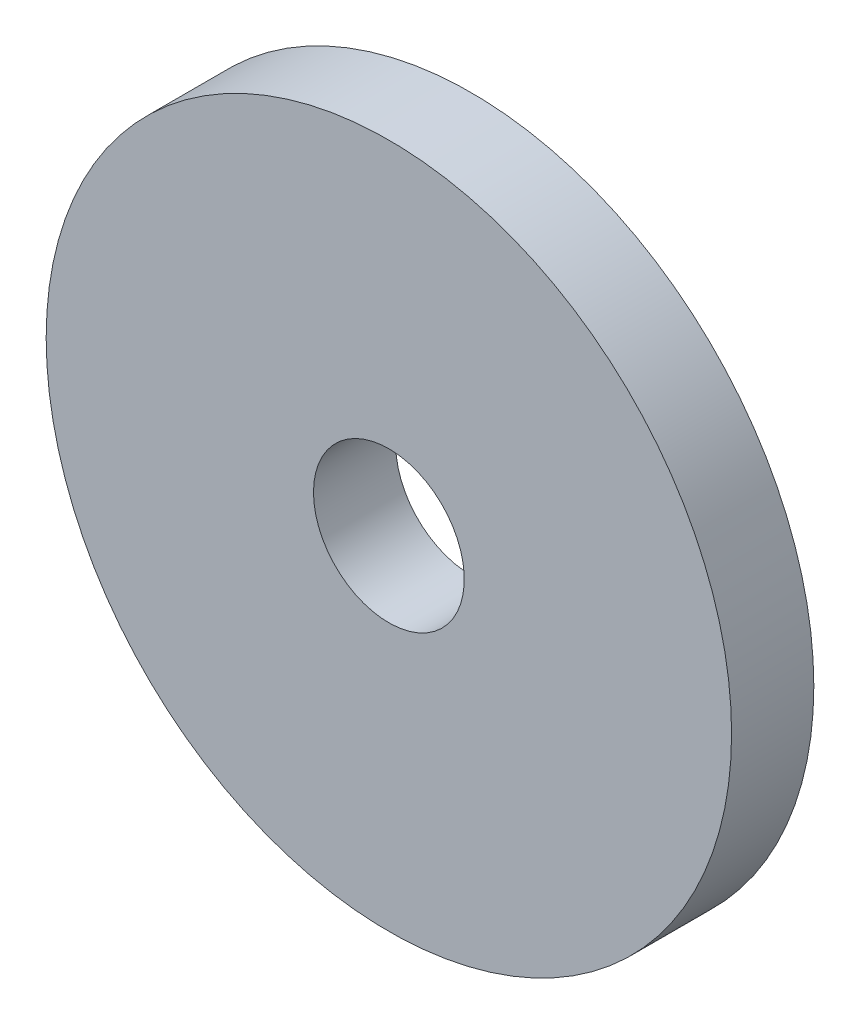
from build123d import *

# Parameters (mm, degrees)
SKETCH1_R           = 3.175
BOSS_EXTRUDE1_DEPTH = 0.762
SKETCH2_R           = 0.6985
CUT_EXTRUDE2_DEPTH  = 5.554326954


with BuildPart() as part:
    # Sketch1 → Boss-Extrude1 (new body)
    with BuildSketch(Plane.XY):
        with Locations(Location((0, 0, 0), (0, 0, 180))):
            Circle(SKETCH1_R)
    extrude(amount=BOSS_EXTRUDE1_DEPTH)

    # Sketch2 → Cut-Extrude2 (cut, through all)
    with BuildSketch(Plane.XY):
        with Locations(Location((0, 0, 0), (0, 0, 180))):
            Circle(SKETCH2_R)
    extrude(amount=CUT_EXTRUDE2_DEPTH, mode=Mode.SUBTRACT)


solid = part.part
